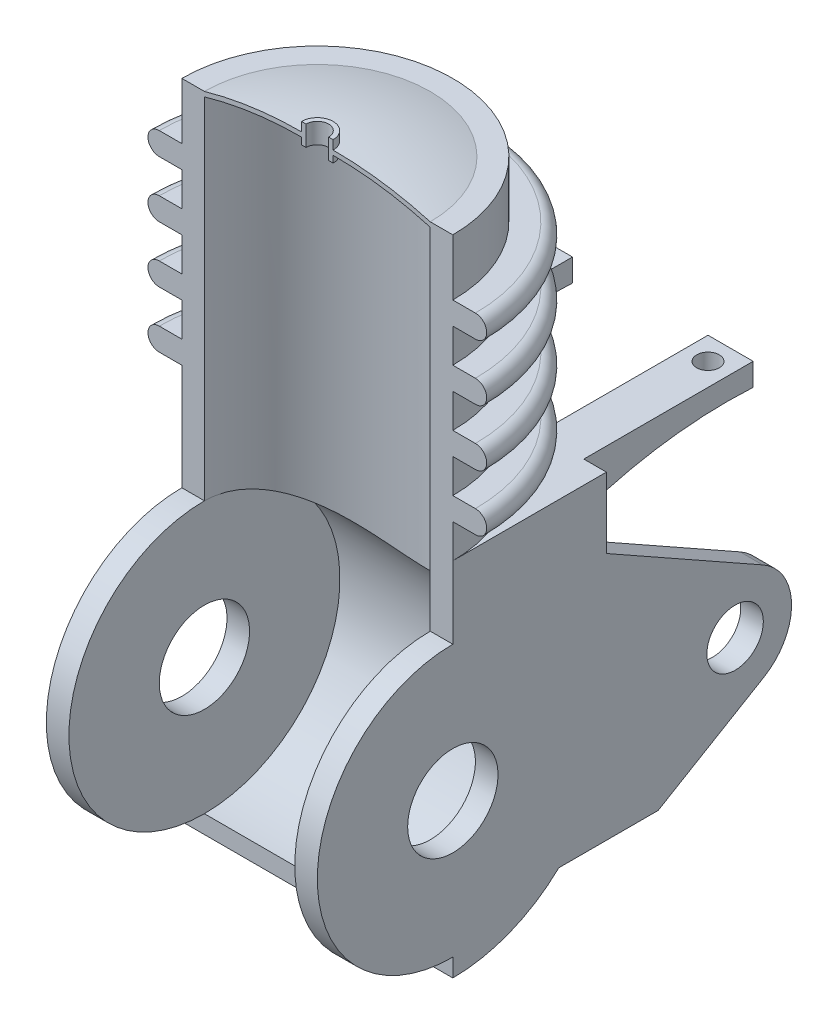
from build123d import *

# Parameters (mm, degrees)
BOSS_EXTRUDE1_DEPTH     = 60
REVOLVE1_ANGLE          = 180
SKETCH3_R               = 60
CUT_EXTRUDE1_DEPTH      = 333.978978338
CUT_EXTRUDE2_REACH      = 193.964
SKETCH4_R               = 50
SKETCH5_W               = 10
SKETCH5_H               = 40
SKETCH6_R               = 12.5
BOSS_EXTRUDE2_DEPTH     = 10
BOSS_EXTRUDE3_DEPTH     = 20
CUT_EXTRUDE3_REACH      = 233.787
CUT_EXTRUDE3_END_RADIUS = 200
SKETCH8_R               = 5


with BuildPart() as part:
    # Sketch1 → Boss-Extrude1 (new, symmetric)
    with BuildSketch(Plane(origin=(0, 0, 0), x_dir=(0, 0, -1), z_dir=(1, 0, 0))):
        with BuildLine():
            Line((0, 0), (0, 160))
            Line((0, 160), (68, 160))
            Line((68, 160), (68, 68))
            ThreePointArc((68, 68), (48.083261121, 19.916738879), (0, 0))
        make_face()
    extrude(amount=BOSS_EXTRUDE1_DEPTH, both=True)

    # Sketch2 → Revolve1 (revolve)
    with BuildSketch(Plane.XY):
        with BuildLine():
            Line((50, 160), (50, 282.919441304))
            ThreePointArc((50, 282.919441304), (28.714011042, 287.473146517), (7, 289))
            Line((7, 289), (7, 286))
            Line((7, 286), (5, 286))
            Line((5, 286), (5, 295))
            Line((5, 295), (7, 295))
            Line((7, 295), (7, 291.000000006))
            ThreePointArc((7, 291.000000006), (28.708404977, 289.493569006), (50, 285))
            Line((50, 285), (60, 285))
            Line((60, 285), (60, 260))
            Line((60, 260), (70, 260))
            ThreePointArc((70, 260), (75, 255), (70, 250))
            Line((70, 250), (60, 250))
            Line((60, 250), (60, 235))
            Line((60, 235), (70, 235))
            ThreePointArc((70, 235), (75, 230), (70, 225))
            Line((70, 225), (60, 225))
            Line((60, 225), (60, 210))
            Line((60, 210), (70, 210))
            ThreePointArc((70, 210), (75, 205), (70, 200))
            Line((70, 200), (60, 200))
            Line((60, 200), (60, 185))
            Line((60, 185), (70, 185))
            ThreePointArc((70, 185), (75, 180), (70, 175))
            Line((70, 175), (60, 175))
            Line((60, 175), (60, 160))
            Line((60, 160), (50, 160))
        make_face()
    revolve(axis=Axis((0, 0, 0), (0, 1, 0)), revolution_arc=REVOLVE1_ANGLE)

    # Sketch3 → Cut-Extrude1 (cut, through all)
    with BuildSketch(Plane(origin=(60, 0, 0), x_dir=(0, 0, -1), z_dir=(1, 0, 0))):
        with Locations((0, 68)):
            Circle(SKETCH3_R)
    extrude(amount=-CUT_EXTRUDE1_DEPTH, mode=Mode.SUBTRACT)

    # Sketch4 → Cut-Extrude2 (cut, up to next)
    with BuildSketch(Plane(origin=(0, 160, 0), x_dir=(1, 0, 0), z_dir=(0, 1, 0)), mode=Mode.PRIVATE) as cut_extrude2_sk1:
        Circle(SKETCH4_R)
    cut_extrude2_tool1 = extrude(cut_extrude2_sk1.sketch, amount=-CUT_EXTRUDE2_REACH, mode=Mode.PRIVATE) & part.part
    add(cut_extrude2_tool1.solids().sort_by_distance((0, 160, 0))[0], mode=Mode.SUBTRACT)

    # Sketch5 → Revolve2 (revolve)
    with BuildSketch(Plane.XY, mode=Mode.PRIVATE) as revolve2_sk:
        with Locations((55, 108)):
            Rectangle(SKETCH5_W, SKETCH5_H)
    revolve2 = revolve(revolve2_sk.sketch.rotate(Axis((-74.434908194, 68, 0), (1, 0, 0)), 90), axis=Axis((-74.434908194, 68, 0), (1, 0, 0)))

    # Mirror1: Revolve2 across plane
    add(revolve2.mirror(Plane(origin=(0, 0, 0), x_dir=(0, 0, 1), z_dir=(1, 0, 0))))

    # Sketch6 → Boss-Extrude2 (add)
    with BuildSketch(Plane(origin=(60, 0, 0), x_dir=(0, 0, -1), z_dir=(1, 0, 0))):
        with BuildLine():
            Line((68, 68), (68, 128.790608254))
            Line((68, 128.790608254), (137.267142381, 89.783416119))
            ThreePointArc((137.267142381, 89.783416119), (149.998562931, 68.268051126), (137.73142055, 46.484635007))
            Line((137.73142055, 46.484635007), (90.930115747, 18.790608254))
            Line((90.930115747, 18.790608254), (46.930115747, 18.790608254))
            ThreePointArc((46.930115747, 18.790608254), (62.510990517, 41.234797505), (68, 68))
        make_face()
        with Locations((125, 68)):
            Circle(SKETCH6_R, mode=Mode.SUBTRACT)
    boss_extrude2 = extrude(amount=-BOSS_EXTRUDE2_DEPTH)

    # Mirror2: Boss-Extrude2 across plane
    add(boss_extrude2.mirror(Plane(origin=(0, 0, 0), x_dir=(0, 0, 1), z_dir=(1, 0, 0))))

    # Sketch7 → Boss-Extrude3 (add)
    with BuildSketch(Plane(origin=(50, 0, 0), x_dir=(0, 0, -1), z_dir=(1, 0, 0))):
        with BuildLine():
            Line((68, 160), (143, 160))
            Line((143, 160), (143, 150))
            ThreePointArc((143, 150), (105.022794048, 148.579044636), (68, 140))
            Line((68, 140), (68, 160))
        make_face()
    boss_extrude3 = extrude(amount=-BOSS_EXTRUDE3_DEPTH)

    # Mirror3: Boss-Extrude3 across plane
    add(boss_extrude3.mirror(Plane(origin=(0, 0, 0), x_dir=(0, 0, 1), z_dir=(1, 0, 0))))

    # Cut-Extrude3: up to this cylinder (the profile starts outside it)
    cut_extrude3_end = Plane(origin=(0, -49.6665355, -131.455538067), z_dir=(1, 0, 0)) * Cylinder(CUT_EXTRUDE3_END_RADIUS, 948.574, mode=Mode.PRIVATE)
    # Sketch8 → Cut-Extrude3 (cut, up to the surface)
    with BuildSketch(Plane(origin=(0, 160, 0), x_dir=(1, 0, 0), z_dir=(0, 1, 0)), mode=Mode.PRIVATE) as cut_extrude3_sk1:
        with Locations(Location((-40, 133, 0), (0, 0, 270))):
            Circle(SKETCH8_R)
    cut_extrude3_tool1 = extrude(cut_extrude3_sk1.sketch, amount=-CUT_EXTRUDE3_REACH, mode=Mode.PRIVATE) - cut_extrude3_end
    add(cut_extrude3_tool1.solids().sort_by_distance((-40, 160, -133))[0], mode=Mode.SUBTRACT)
    # Sketch8 → Cut-Extrude3 (cut, up to the surface)
    with BuildSketch(Plane(origin=(0, 160, 0), x_dir=(1, 0, 0), z_dir=(0, 1, 0)), mode=Mode.PRIVATE) as cut_extrude3_sk2:
        with Locations(Location((40, 133, 0), (0, 0, 270))):
            Circle(SKETCH8_R)
    cut_extrude3_tool2 = extrude(cut_extrude3_sk2.sketch, amount=-CUT_EXTRUDE3_REACH, mode=Mode.PRIVATE) - cut_extrude3_end
    add(cut_extrude3_tool2.solids().sort_by_distance((40, 160, -133))[0], mode=Mode.SUBTRACT)


solid = part.part
